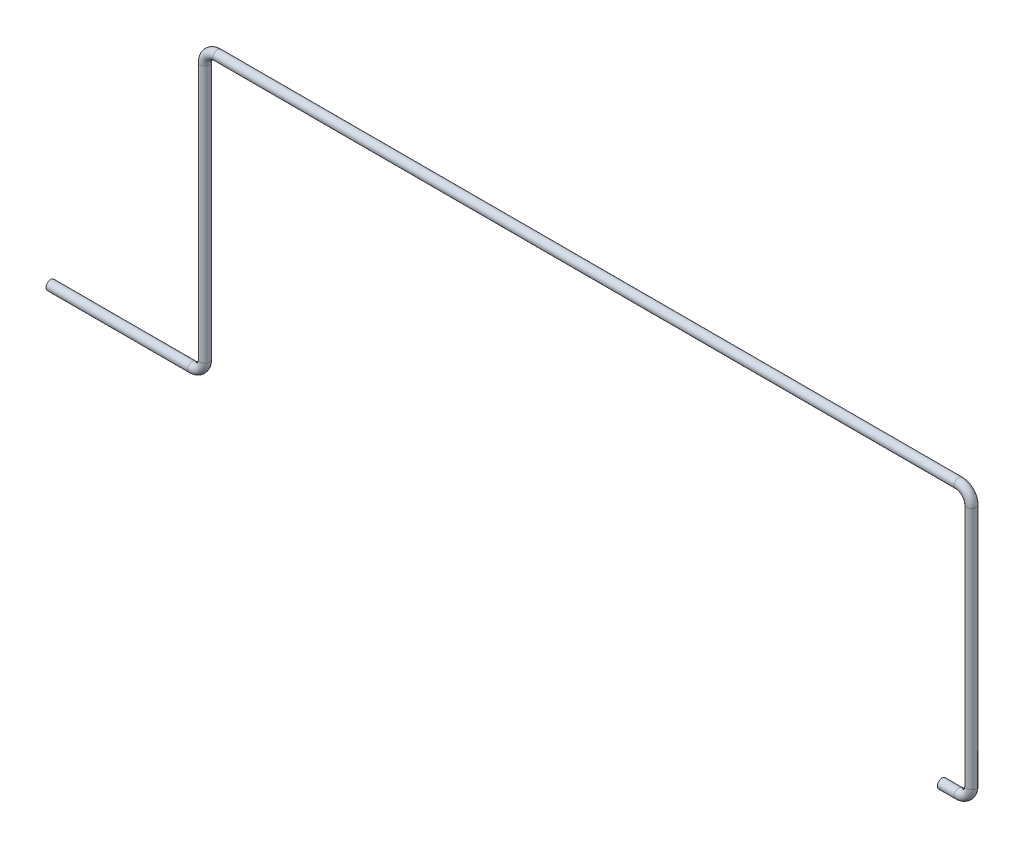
ISO-10303-21;
HEADER;
FILE_DESCRIPTION(('STEP AP214'),'2;1');
FILE_NAME('part.step','',(''),(''),'','','');
FILE_SCHEMA(('AUTOMOTIVE_DESIGN { 1 0 10303 214 1 1 1 1 }'));
ENDSEC;
DATA;
#1=APPLICATION_CONTEXT('core data for automotive mechanical design processes');
#2=APPLICATION_PROTOCOL_DEFINITION('international standard','automotive_design',2000,#1);
#3=PRODUCT_CONTEXT('',#1,'mechanical');
#4=PRODUCT('Part','Part','',(#3));
#5=PRODUCT_RELATED_PRODUCT_CATEGORY('part','',(#4));
#6=PRODUCT_DEFINITION_FORMATION('','',#4);
#7=PRODUCT_DEFINITION_CONTEXT('part definition',#1,'design');
#8=PRODUCT_DEFINITION('design','',#6,#7);
#9=PRODUCT_DEFINITION_SHAPE('','',#8);
#10=(LENGTH_UNIT() NAMED_UNIT(*) SI_UNIT(.MILLI.,.METRE.));
#11=(NAMED_UNIT(*) PLANE_ANGLE_UNIT() SI_UNIT($,.RADIAN.));
#12=(NAMED_UNIT(*) SI_UNIT($,.STERADIAN.) SOLID_ANGLE_UNIT());
#13=UNCERTAINTY_MEASURE_WITH_UNIT(LENGTH_MEASURE(1.E-05),#10,'distance_accuracy_value','');
#14=(GEOMETRIC_REPRESENTATION_CONTEXT(3) GLOBAL_UNCERTAINTY_ASSIGNED_CONTEXT((#13)) GLOBAL_UNIT_ASSIGNED_CONTEXT((#10,
#11,#12)) REPRESENTATION_CONTEXT('',''));
#15=CARTESIAN_POINT('',(0.,0.,0.));
#16=DIRECTION('',(0.,0.,1.));
#17=DIRECTION('',(1.,0.,0.));
#18=AXIS2_PLACEMENT_3D('',#15,#16,#17);
#19=CARTESIAN_POINT('',(4325.,66.4000000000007,0.));
#20=DIRECTION('',(-1.,0.,0.));
#21=DIRECTION('',(0.,-1.,0.));
#22=AXIS2_PLACEMENT_3D('',#19,#20,#21);
#23=CYLINDRICAL_SURFACE('',#22,22.25);
#24=CARTESIAN_POINT('',(4325.,66.4000000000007,0.));
#25=DIRECTION('',(-1.,0.,0.));
#26=DIRECTION('',(0.,0.,-1.));
#27=AXIS2_PLACEMENT_3D('',#24,#25,#26);
#28=CIRCLE('',#27,22.25);
#29=CARTESIAN_POINT('',(4325.,44.1500000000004,0.));
#30=VERTEX_POINT('',#29);
#31=EDGE_CURVE('E39',#30,#30,#28,.T.);
#32=ORIENTED_EDGE('',*,*,#31,.T.);
#33=EDGE_LOOP('',(#32));
#34=FACE_BOUND('',#33,.T.);
#35=CARTESIAN_POINT('',(4245.,66.4000000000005,0.));
#36=DIRECTION('',(-1.,0.,0.));
#37=DIRECTION('',(0.,0.,-1.));
#38=AXIS2_PLACEMENT_3D('',#35,#36,#37);
#39=CIRCLE('',#38,22.25);
#40=CARTESIAN_POINT('',(4245.,66.4000000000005,-22.25));
#41=VERTEX_POINT('',#40);
#42=EDGE_CURVE('E10',#41,#41,#39,.T.);
#43=ORIENTED_EDGE('',*,*,#42,.F.);
#44=EDGE_LOOP('',(#43));
#45=FACE_BOUND('',#44,.T.);
#46=ADVANCED_FACE('F29',(#34,#45),#23,.T.);
#47=CARTESIAN_POINT('',(4325.,66.4000000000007,0.));
#48=DIRECTION('',(-1.,0.,0.));
#49=DIRECTION('',(0.,-1.,0.));
#50=AXIS2_PLACEMENT_3D('',#47,#48,#49);
#51=CYLINDRICAL_SURFACE('',#50,19.05);
#52=CARTESIAN_POINT('',(4325.,66.4000000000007,0.));
#53=DIRECTION('',(-1.,0.,0.));
#54=DIRECTION('',(0.,0.,-1.));
#55=AXIS2_PLACEMENT_3D('',#52,#53,#54);
#56=CIRCLE('',#55,19.05);
#57=CARTESIAN_POINT('',(4325.,47.3500000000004,0.));
#58=VERTEX_POINT('',#57);
#59=EDGE_CURVE('E43',#58,#58,#56,.T.);
#60=ORIENTED_EDGE('',*,*,#59,.F.);
#61=EDGE_LOOP('',(#60));
#62=FACE_BOUND('',#61,.T.);
#63=CARTESIAN_POINT('',(4245.,66.4000000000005,0.));
#64=DIRECTION('',(-1.,0.,0.));
#65=DIRECTION('',(0.,0.,-1.));
#66=AXIS2_PLACEMENT_3D('',#63,#64,#65);
#67=CIRCLE('',#66,19.05);
#68=CARTESIAN_POINT('',(4245.,66.4000000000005,-19.05));
#69=VERTEX_POINT('',#68);
#70=EDGE_CURVE('E35',#69,#69,#67,.T.);
#71=ORIENTED_EDGE('',*,*,#70,.T.);
#72=EDGE_LOOP('',(#71));
#73=FACE_BOUND('',#72,.T.);
#74=ADVANCED_FACE('F149',(#62,#73),#51,.F.);
#75=CARTESIAN_POINT('',(4325.,126.4,0.));
#76=DIRECTION('',(0.,0.,-1.));
#77=DIRECTION('',(-1.,0.,0.));
#78=AXIS2_PLACEMENT_3D('',#75,#76,#77);
#79=TOROIDAL_SURFACE('',#78,59.9999999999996,22.25);
#80=CARTESIAN_POINT('',(4385.,126.4,0.));
#81=DIRECTION('',(0.,-1.,0.));
#82=DIRECTION('',(0.,0.,-1.));
#83=AXIS2_PLACEMENT_3D('',#80,#81,#82);
#84=CIRCLE('',#83,22.25);
#85=CARTESIAN_POINT('',(4407.25,126.399999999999,0.));
#86=VERTEX_POINT('',#85);
#87=EDGE_CURVE('E48',#86,#86,#84,.T.);
#88=CARTESIAN_POINT('',(4325.,126.4,0.));
#89=DIRECTION('',(0.,0.,-1.));
#90=DIRECTION('',(-1.,0.,0.));
#91=AXIS2_PLACEMENT_3D('',#88,#89,#90);
#92=CIRCLE('',#91,82.2499999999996);
#93=EDGE_CURVE('',#86,#30,#92,.T.);
#94=ORIENTED_EDGE('',*,*,#87,.T.);
#95=ORIENTED_EDGE('',*,*,#31,.F.);
#96=ORIENTED_EDGE('',*,*,#93,.T.);
#97=ORIENTED_EDGE('',*,*,#93,.F.);
#98=EDGE_LOOP('',(#94,#96,#95,#97));
#99=FACE_BOUND('',#98,.T.);
#100=ADVANCED_FACE('F145',(#99),#79,.T.);
#101=CARTESIAN_POINT('',(4325.,126.4,0.));
#102=DIRECTION('',(0.,0.,-1.));
#103=DIRECTION('',(-1.,0.,0.));
#104=AXIS2_PLACEMENT_3D('',#101,#102,#103);
#105=TOROIDAL_SURFACE('',#104,59.9999999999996,19.05);
#106=CARTESIAN_POINT('',(4385.,126.4,0.));
#107=DIRECTION('',(0.,-1.,0.));
#108=DIRECTION('',(0.,0.,-1.));
#109=AXIS2_PLACEMENT_3D('',#106,#107,#108);
#110=CIRCLE('',#109,19.05);
#111=CARTESIAN_POINT('',(4404.05,126.4,0.));
#112=VERTEX_POINT('',#111);
#113=EDGE_CURVE('E51',#112,#112,#110,.T.);
#114=CARTESIAN_POINT('',(4325.,126.4,0.));
#115=DIRECTION('',(0.,0.,-1.));
#116=DIRECTION('',(-1.,0.,0.));
#117=AXIS2_PLACEMENT_3D('',#114,#115,#116);
#118=CIRCLE('',#117,79.0499999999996);
#119=EDGE_CURVE('',#112,#58,#118,.T.);
#120=ORIENTED_EDGE('',*,*,#113,.F.);
#121=ORIENTED_EDGE('',*,*,#59,.T.);
#122=ORIENTED_EDGE('',*,*,#119,.T.);
#123=ORIENTED_EDGE('',*,*,#119,.F.);
#124=EDGE_LOOP('',(#120,#122,#121,#123));
#125=FACE_BOUND('',#124,.T.);
#126=ADVANCED_FACE('F142',(#125),#105,.F.);
#127=CARTESIAN_POINT('',(4385.,1286.4,0.));
#128=DIRECTION('',(0.,-1.,0.));
#129=DIRECTION('',(0.,0.,-1.));
#130=AXIS2_PLACEMENT_3D('',#127,#128,#129);
#131=CYLINDRICAL_SURFACE('',#130,22.25);
#132=CARTESIAN_POINT('',(4385.,1286.4,0.));
#133=DIRECTION('',(0.,-1.,0.));
#134=DIRECTION('',(0.,0.,-1.));
#135=AXIS2_PLACEMENT_3D('',#132,#133,#134);
#136=CIRCLE('',#135,22.25);
#137=CARTESIAN_POINT('',(4407.25,1286.4,0.));
#138=VERTEX_POINT('',#137);
#139=EDGE_CURVE('E54',#138,#138,#136,.T.);
#140=ORIENTED_EDGE('',*,*,#139,.T.);
#141=EDGE_LOOP('',(#140));
#142=FACE_BOUND('',#141,.T.);
#143=ORIENTED_EDGE('',*,*,#87,.F.);
#144=EDGE_LOOP('',(#143));
#145=FACE_BOUND('',#144,.T.);
#146=ADVANCED_FACE('F138',(#142,#145),#131,.T.);
#147=CARTESIAN_POINT('',(4385.,1286.4,0.));
#148=DIRECTION('',(0.,-1.,0.));
#149=DIRECTION('',(0.,0.,-1.));
#150=AXIS2_PLACEMENT_3D('',#147,#148,#149);
#151=CYLINDRICAL_SURFACE('',#150,19.05);
#152=CARTESIAN_POINT('',(4385.,1286.4,0.));
#153=DIRECTION('',(0.,-1.,0.));
#154=DIRECTION('',(0.,0.,-1.));
#155=AXIS2_PLACEMENT_3D('',#152,#153,#154);
#156=CIRCLE('',#155,19.05);
#157=CARTESIAN_POINT('',(4404.05,1286.4,0.));
#158=VERTEX_POINT('',#157);
#159=EDGE_CURVE('E57',#158,#158,#156,.T.);
#160=ORIENTED_EDGE('',*,*,#159,.F.);
#161=EDGE_LOOP('',(#160));
#162=FACE_BOUND('',#161,.T.);
#163=ORIENTED_EDGE('',*,*,#113,.T.);
#164=EDGE_LOOP('',(#163));
#165=FACE_BOUND('',#164,.T.);
#166=ADVANCED_FACE('F135',(#162,#165),#151,.F.);
#167=CARTESIAN_POINT('',(4325.,1286.4,0.));
#168=DIRECTION('',(0.,0.,-1.));
#169=DIRECTION('',(-1.,0.,0.));
#170=AXIS2_PLACEMENT_3D('',#167,#168,#169);
#171=TOROIDAL_SURFACE('',#170,60.0000000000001,22.25);
#172=CARTESIAN_POINT('',(4325.,1346.4,0.));
#173=DIRECTION('',(1.,0.,0.));
#174=DIRECTION('',(0.,0.,-1.));
#175=AXIS2_PLACEMENT_3D('',#172,#173,#174);
#176=CIRCLE('',#175,22.25);
#177=CARTESIAN_POINT('',(4325.,1368.65,0.));
#178=VERTEX_POINT('',#177);
#179=EDGE_CURVE('E60',#178,#178,#176,.T.);
#180=CARTESIAN_POINT('',(4325.,1286.4,0.));
#181=DIRECTION('',(0.,0.,-1.));
#182=DIRECTION('',(-1.,0.,0.));
#183=AXIS2_PLACEMENT_3D('',#180,#181,#182);
#184=CIRCLE('',#183,82.25);
#185=EDGE_CURVE('',#178,#138,#184,.T.);
#186=ORIENTED_EDGE('',*,*,#179,.T.);
#187=ORIENTED_EDGE('',*,*,#139,.F.);
#188=ORIENTED_EDGE('',*,*,#185,.T.);
#189=ORIENTED_EDGE('',*,*,#185,.F.);
#190=EDGE_LOOP('',(#186,#188,#187,#189));
#191=FACE_BOUND('',#190,.T.);
#192=ADVANCED_FACE('F131',(#191),#171,.T.);
#193=CARTESIAN_POINT('',(4325.,1286.4,0.));
#194=DIRECTION('',(0.,0.,-1.));
#195=DIRECTION('',(-1.,0.,0.));
#196=AXIS2_PLACEMENT_3D('',#193,#194,#195);
#197=TOROIDAL_SURFACE('',#196,60.0000000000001,19.05);
#198=CARTESIAN_POINT('',(4325.,1346.4,0.));
#199=DIRECTION('',(1.,0.,0.));
#200=DIRECTION('',(0.,0.,-1.));
#201=AXIS2_PLACEMENT_3D('',#198,#199,#200);
#202=CIRCLE('',#201,19.05);
#203=CARTESIAN_POINT('',(4325.,1365.45,0.));
#204=VERTEX_POINT('',#203);
#205=EDGE_CURVE('E63',#204,#204,#202,.T.);
#206=CARTESIAN_POINT('',(4325.,1286.4,0.));
#207=DIRECTION('',(0.,0.,-1.));
#208=DIRECTION('',(-1.,0.,0.));
#209=AXIS2_PLACEMENT_3D('',#206,#207,#208);
#210=CIRCLE('',#209,79.0500000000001);
#211=EDGE_CURVE('',#204,#158,#210,.T.);
#212=ORIENTED_EDGE('',*,*,#205,.F.);
#213=ORIENTED_EDGE('',*,*,#159,.T.);
#214=ORIENTED_EDGE('',*,*,#211,.T.);
#215=ORIENTED_EDGE('',*,*,#211,.F.);
#216=EDGE_LOOP('',(#212,#214,#213,#215));
#217=FACE_BOUND('',#216,.T.);
#218=ADVANCED_FACE('F128',(#217),#197,.F.);
#219=CARTESIAN_POINT('',(795.,1346.4,0.));
#220=DIRECTION('',(1.,0.,0.));
#221=DIRECTION('',(0.,0.,-1.));
#222=AXIS2_PLACEMENT_3D('',#219,#220,#221);
#223=CYLINDRICAL_SURFACE('',#222,22.25);
#224=CARTESIAN_POINT('',(795.,1346.4,0.));
#225=DIRECTION('',(1.,0.,0.));
#226=DIRECTION('',(0.,0.,-1.));
#227=AXIS2_PLACEMENT_3D('',#224,#225,#226);
#228=CIRCLE('',#227,22.25);
#229=CARTESIAN_POINT('',(795.,1368.65,0.));
#230=VERTEX_POINT('',#229);
#231=EDGE_CURVE('E66',#230,#230,#228,.T.);
#232=ORIENTED_EDGE('',*,*,#231,.T.);
#233=EDGE_LOOP('',(#232));
#234=FACE_BOUND('',#233,.T.);
#235=ORIENTED_EDGE('',*,*,#179,.F.);
#236=EDGE_LOOP('',(#235));
#237=FACE_BOUND('',#236,.T.);
#238=ADVANCED_FACE('F124',(#234,#237),#223,.T.);
#239=CARTESIAN_POINT('',(795.,1346.4,0.));
#240=DIRECTION('',(1.,0.,0.));
#241=DIRECTION('',(0.,0.,-1.));
#242=AXIS2_PLACEMENT_3D('',#239,#240,#241);
#243=CYLINDRICAL_SURFACE('',#242,19.05);
#244=CARTESIAN_POINT('',(795.,1346.4,0.));
#245=DIRECTION('',(1.,0.,0.));
#246=DIRECTION('',(0.,0.,-1.));
#247=AXIS2_PLACEMENT_3D('',#244,#245,#246);
#248=CIRCLE('',#247,19.05);
#249=CARTESIAN_POINT('',(795.,1365.45,0.));
#250=VERTEX_POINT('',#249);
#251=EDGE_CURVE('E69',#250,#250,#248,.T.);
#252=ORIENTED_EDGE('',*,*,#251,.F.);
#253=EDGE_LOOP('',(#252));
#254=FACE_BOUND('',#253,.T.);
#255=ORIENTED_EDGE('',*,*,#205,.T.);
#256=EDGE_LOOP('',(#255));
#257=FACE_BOUND('',#256,.T.);
#258=ADVANCED_FACE('F121',(#254,#257),#243,.F.);
#259=CARTESIAN_POINT('',(795.,1286.4,0.));
#260=DIRECTION('',(0.,0.,-1.));
#261=DIRECTION('',(-1.,0.,0.));
#262=AXIS2_PLACEMENT_3D('',#259,#260,#261);
#263=TOROIDAL_SURFACE('',#262,60.0000000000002,22.25);
#264=CARTESIAN_POINT('',(735.,1286.4,0.));
#265=DIRECTION('',(0.,1.,0.));
#266=DIRECTION('',(0.,0.,-1.));
#267=AXIS2_PLACEMENT_3D('',#264,#265,#266);
#268=CIRCLE('',#267,22.25);
#269=CARTESIAN_POINT('',(712.75,1286.4,0.));
#270=VERTEX_POINT('',#269);
#271=EDGE_CURVE('E72',#270,#270,#268,.T.);
#272=CARTESIAN_POINT('',(795.,1286.4,0.));
#273=DIRECTION('',(0.,0.,-1.));
#274=DIRECTION('',(-1.,0.,0.));
#275=AXIS2_PLACEMENT_3D('',#272,#273,#274);
#276=CIRCLE('',#275,82.2500000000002);
#277=EDGE_CURVE('',#270,#230,#276,.T.);
#278=ORIENTED_EDGE('',*,*,#271,.T.);
#279=ORIENTED_EDGE('',*,*,#231,.F.);
#280=ORIENTED_EDGE('',*,*,#277,.T.);
#281=ORIENTED_EDGE('',*,*,#277,.F.);
#282=EDGE_LOOP('',(#278,#280,#279,#281));
#283=FACE_BOUND('',#282,.T.);
#284=ADVANCED_FACE('F117',(#283),#263,.T.);
#285=CARTESIAN_POINT('',(795.,1286.4,0.));
#286=DIRECTION('',(0.,0.,-1.));
#287=DIRECTION('',(-1.,0.,0.));
#288=AXIS2_PLACEMENT_3D('',#285,#286,#287);
#289=TOROIDAL_SURFACE('',#288,60.0000000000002,19.05);
#290=CARTESIAN_POINT('',(735.,1286.4,0.));
#291=DIRECTION('',(0.,1.,0.));
#292=DIRECTION('',(0.,0.,-1.));
#293=AXIS2_PLACEMENT_3D('',#290,#291,#292);
#294=CIRCLE('',#293,19.05);
#295=CARTESIAN_POINT('',(715.95,1286.4,0.));
#296=VERTEX_POINT('',#295);
#297=EDGE_CURVE('E75',#296,#296,#294,.T.);
#298=CARTESIAN_POINT('',(795.,1286.4,0.));
#299=DIRECTION('',(0.,0.,-1.));
#300=DIRECTION('',(-1.,0.,0.));
#301=AXIS2_PLACEMENT_3D('',#298,#299,#300);
#302=CIRCLE('',#301,79.0500000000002);
#303=EDGE_CURVE('',#296,#250,#302,.T.);
#304=ORIENTED_EDGE('',*,*,#297,.F.);
#305=ORIENTED_EDGE('',*,*,#251,.T.);
#306=ORIENTED_EDGE('',*,*,#303,.T.);
#307=ORIENTED_EDGE('',*,*,#303,.F.);
#308=EDGE_LOOP('',(#304,#306,#305,#307));
#309=FACE_BOUND('',#308,.T.);
#310=ADVANCED_FACE('F114',(#309),#289,.F.);
#311=CARTESIAN_POINT('',(735.,59.9999999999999,0.));
#312=DIRECTION('',(0.,1.,0.));
#313=DIRECTION('',(0.,0.,1.));
#314=AXIS2_PLACEMENT_3D('',#311,#312,#313);
#315=CYLINDRICAL_SURFACE('',#314,22.25);
#316=CARTESIAN_POINT('',(735.,59.9999999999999,0.));
#317=DIRECTION('',(0.,1.,0.));
#318=DIRECTION('',(0.,0.,-1.));
#319=AXIS2_PLACEMENT_3D('',#316,#317,#318);
#320=CIRCLE('',#319,22.25);
#321=CARTESIAN_POINT('',(757.25,59.9999999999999,0.));
#322=VERTEX_POINT('',#321);
#323=EDGE_CURVE('E78',#322,#322,#320,.T.);
#324=ORIENTED_EDGE('',*,*,#323,.T.);
#325=EDGE_LOOP('',(#324));
#326=FACE_BOUND('',#325,.T.);
#327=ORIENTED_EDGE('',*,*,#271,.F.);
#328=EDGE_LOOP('',(#327));
#329=FACE_BOUND('',#328,.T.);
#330=ADVANCED_FACE('F110',(#326,#329),#315,.T.);
#331=CARTESIAN_POINT('',(735.,59.9999999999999,0.));
#332=DIRECTION('',(0.,1.,0.));
#333=DIRECTION('',(0.,0.,1.));
#334=AXIS2_PLACEMENT_3D('',#331,#332,#333);
#335=CYLINDRICAL_SURFACE('',#334,19.05);
#336=CARTESIAN_POINT('',(735.,59.9999999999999,0.));
#337=DIRECTION('',(0.,1.,0.));
#338=DIRECTION('',(0.,0.,-1.));
#339=AXIS2_PLACEMENT_3D('',#336,#337,#338);
#340=CIRCLE('',#339,19.05);
#341=CARTESIAN_POINT('',(754.05,59.9999999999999,0.));
#342=VERTEX_POINT('',#341);
#343=EDGE_CURVE('E81',#342,#342,#340,.T.);
#344=ORIENTED_EDGE('',*,*,#343,.F.);
#345=EDGE_LOOP('',(#344));
#346=FACE_BOUND('',#345,.T.);
#347=ORIENTED_EDGE('',*,*,#297,.T.);
#348=EDGE_LOOP('',(#347));
#349=FACE_BOUND('',#348,.T.);
#350=ADVANCED_FACE('F107',(#346,#349),#335,.F.);
#351=CARTESIAN_POINT('',(675.,60.,0.));
#352=DIRECTION('',(0.,0.,1.));
#353=DIRECTION('',(1.,0.,0.));
#354=AXIS2_PLACEMENT_3D('',#351,#352,#353);
#355=TOROIDAL_SURFACE('',#354,60.,22.25);
#356=CARTESIAN_POINT('',(675.,0.,0.));
#357=DIRECTION('',(1.,0.,0.));
#358=DIRECTION('',(0.,0.,-1.));
#359=AXIS2_PLACEMENT_3D('',#356,#357,#358);
#360=CIRCLE('',#359,22.25);
#361=CARTESIAN_POINT('',(675.,-22.25,0.));
#362=VERTEX_POINT('',#361);
#363=EDGE_CURVE('E84',#362,#362,#360,.T.);
#364=CARTESIAN_POINT('',(675.,60.,0.));
#365=DIRECTION('',(0.,0.,1.));
#366=DIRECTION('',(1.,0.,0.));
#367=AXIS2_PLACEMENT_3D('',#364,#365,#366);
#368=CIRCLE('',#367,82.25);
#369=EDGE_CURVE('',#362,#322,#368,.T.);
#370=ORIENTED_EDGE('',*,*,#363,.T.);
#371=ORIENTED_EDGE('',*,*,#323,.F.);
#372=ORIENTED_EDGE('',*,*,#369,.T.);
#373=ORIENTED_EDGE('',*,*,#369,.F.);
#374=EDGE_LOOP('',(#370,#372,#371,#373));
#375=FACE_BOUND('',#374,.T.);
#376=ADVANCED_FACE('F103',(#375),#355,.T.);
#377=CARTESIAN_POINT('',(675.,60.,0.));
#378=DIRECTION('',(0.,0.,1.));
#379=DIRECTION('',(1.,0.,0.));
#380=AXIS2_PLACEMENT_3D('',#377,#378,#379);
#381=TOROIDAL_SURFACE('',#380,60.,19.05);
#382=CARTESIAN_POINT('',(675.,0.,0.));
#383=DIRECTION('',(1.,0.,0.));
#384=DIRECTION('',(0.,0.,-1.));
#385=AXIS2_PLACEMENT_3D('',#382,#383,#384);
#386=CIRCLE('',#385,19.05);
#387=CARTESIAN_POINT('',(675.,-19.05,0.));
#388=VERTEX_POINT('',#387);
#389=EDGE_CURVE('E88',#388,#388,#386,.T.);
#390=CARTESIAN_POINT('',(675.,60.,0.));
#391=DIRECTION('',(0.,0.,1.));
#392=DIRECTION('',(1.,0.,0.));
#393=AXIS2_PLACEMENT_3D('',#390,#391,#392);
#394=CIRCLE('',#393,79.05);
#395=EDGE_CURVE('',#388,#342,#394,.T.);
#396=ORIENTED_EDGE('',*,*,#389,.F.);
#397=ORIENTED_EDGE('',*,*,#343,.T.);
#398=ORIENTED_EDGE('',*,*,#395,.T.);
#399=ORIENTED_EDGE('',*,*,#395,.F.);
#400=EDGE_LOOP('',(#396,#398,#397,#399));
#401=FACE_BOUND('',#400,.T.);
#402=ADVANCED_FACE('F100',(#401),#381,.F.);
#403=CARTESIAN_POINT('',(675.,0.,0.));
#404=DIRECTION('',(-1.,0.,0.));
#405=DIRECTION('',(0.,0.,1.));
#406=AXIS2_PLACEMENT_3D('',#403,#404,#405);
#407=CYLINDRICAL_SURFACE('',#406,19.05);
#408=ORIENTED_EDGE('',*,*,#389,.T.);
#409=EDGE_LOOP('',(#408));
#410=FACE_BOUND('',#409,.T.);
#411=CARTESIAN_POINT('',(0.,0.,0.));
#412=DIRECTION('',(1.,0.,0.));
#413=DIRECTION('',(0.,0.,-1.));
#414=AXIS2_PLACEMENT_3D('',#411,#412,#413);
#415=CIRCLE('',#414,19.05);
#416=CARTESIAN_POINT('',(0.,0.,-19.05));
#417=VERTEX_POINT('',#416);
#418=EDGE_CURVE('E89',#417,#417,#415,.T.);
#419=ORIENTED_EDGE('',*,*,#418,.F.);
#420=EDGE_LOOP('',(#419));
#421=FACE_BOUND('',#420,.T.);
#422=ADVANCED_FACE('F97',(#410,#421),#407,.F.);
#423=CARTESIAN_POINT('',(675.,0.,0.));
#424=DIRECTION('',(-1.,0.,0.));
#425=DIRECTION('',(0.,0.,1.));
#426=AXIS2_PLACEMENT_3D('',#423,#424,#425);
#427=CYLINDRICAL_SURFACE('',#426,22.25);
#428=ORIENTED_EDGE('',*,*,#363,.F.);
#429=EDGE_LOOP('',(#428));
#430=FACE_BOUND('',#429,.T.);
#431=CARTESIAN_POINT('',(0.,0.,0.));
#432=DIRECTION('',(1.,0.,0.));
#433=DIRECTION('',(0.,0.,-1.));
#434=AXIS2_PLACEMENT_3D('',#431,#432,#433);
#435=CIRCLE('',#434,22.25);
#436=CARTESIAN_POINT('',(0.,0.,-22.25));
#437=VERTEX_POINT('',#436);
#438=EDGE_CURVE('E85',#437,#437,#435,.T.);
#439=ORIENTED_EDGE('',*,*,#438,.T.);
#440=EDGE_LOOP('',(#439));
#441=FACE_BOUND('',#440,.T.);
#442=ADVANCED_FACE('F179',(#430,#441),#427,.T.);
#443=CARTESIAN_POINT('',(4245.,66.4000000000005,0.));
#444=DIRECTION('',(-1.,0.,0.));
#445=DIRECTION('',(0.,0.,-1.));
#446=AXIS2_PLACEMENT_3D('',#443,#444,#445);
#447=PLANE('',#446);
#448=ORIENTED_EDGE('',*,*,#70,.F.);
#449=EDGE_LOOP('',(#448));
#450=FACE_BOUND('',#449,.T.);
#451=ORIENTED_EDGE('',*,*,#42,.T.);
#452=EDGE_LOOP('',(#451));
#453=FACE_BOUND('',#452,.T.);
#454=ADVANCED_FACE('F182',(#450,#453),#447,.T.);
#455=CARTESIAN_POINT('',(0.,0.,0.));
#456=DIRECTION('',(1.,0.,0.));
#457=DIRECTION('',(0.,0.,-1.));
#458=AXIS2_PLACEMENT_3D('',#455,#456,#457);
#459=PLANE('',#458);
#460=ORIENTED_EDGE('',*,*,#418,.T.);
#461=EDGE_LOOP('',(#460));
#462=FACE_BOUND('',#461,.T.);
#463=ORIENTED_EDGE('',*,*,#438,.F.);
#464=EDGE_LOOP('',(#463));
#465=FACE_BOUND('',#464,.T.);
#466=ADVANCED_FACE('F184',(#462,#465),#459,.F.);
#467=CLOSED_SHELL('',(#46,#74,#100,#126,#146,#166,#192,#218,#238,#258,#284,#310,#330,#350,#376,
#402,#422,#442,#454,#466));
#468=MANIFOLD_SOLID_BREP('B2',#467);
#469=ADVANCED_BREP_SHAPE_REPRESENTATION('',(#18,#468),#14);
#470=SHAPE_DEFINITION_REPRESENTATION(#9,#469);
ENDSEC;
END-ISO-10303-21;
